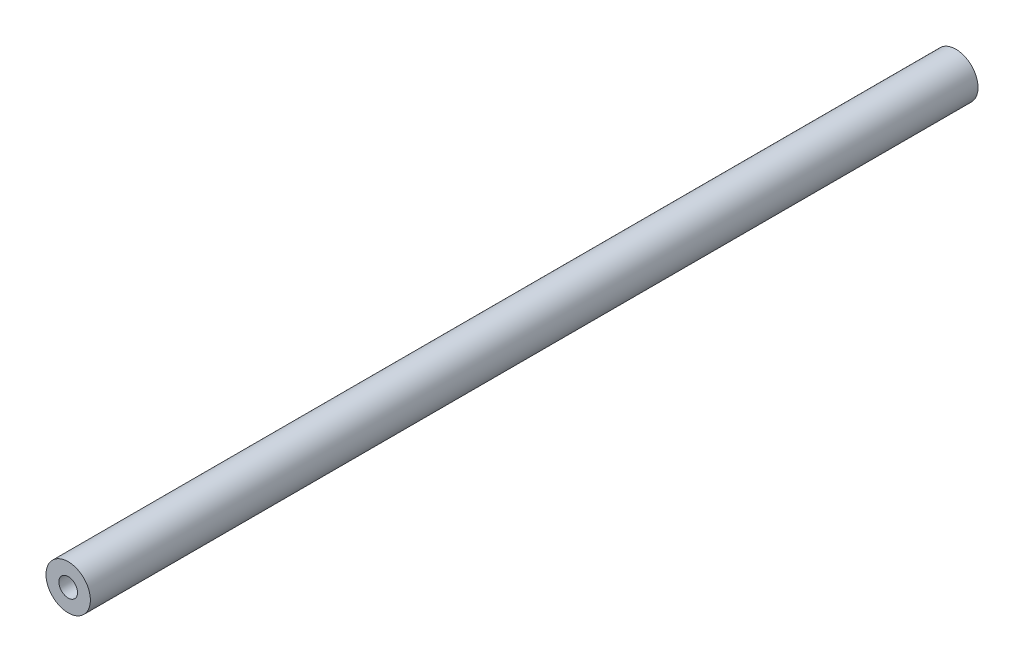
ISO-10303-21;
HEADER;
FILE_DESCRIPTION(('STEP AP214'),'2;1');
FILE_NAME('part.step','',(''),(''),'','','');
FILE_SCHEMA(('AUTOMOTIVE_DESIGN { 1 0 10303 214 1 1 1 1 }'));
ENDSEC;
DATA;
#1=APPLICATION_CONTEXT('core data for automotive mechanical design processes');
#2=APPLICATION_PROTOCOL_DEFINITION('international standard','automotive_design',2000,#1);
#3=PRODUCT_CONTEXT('',#1,'mechanical');
#4=PRODUCT('Part','Part','',(#3));
#5=PRODUCT_RELATED_PRODUCT_CATEGORY('part','',(#4));
#6=PRODUCT_DEFINITION_FORMATION('','',#4);
#7=PRODUCT_DEFINITION_CONTEXT('part definition',#1,'design');
#8=PRODUCT_DEFINITION('design','',#6,#7);
#9=PRODUCT_DEFINITION_SHAPE('','',#8);
#10=(LENGTH_UNIT() NAMED_UNIT(*) SI_UNIT(.MILLI.,.METRE.));
#11=(NAMED_UNIT(*) PLANE_ANGLE_UNIT() SI_UNIT($,.RADIAN.));
#12=(NAMED_UNIT(*) SI_UNIT($,.STERADIAN.) SOLID_ANGLE_UNIT());
#13=UNCERTAINTY_MEASURE_WITH_UNIT(LENGTH_MEASURE(1.E-05),#10,'distance_accuracy_value','');
#14=(GEOMETRIC_REPRESENTATION_CONTEXT(3) GLOBAL_UNCERTAINTY_ASSIGNED_CONTEXT((#13)) GLOBAL_UNIT_ASSIGNED_CONTEXT((#10,
#11,#12)) REPRESENTATION_CONTEXT('',''));
#15=CARTESIAN_POINT('',(0.,0.,0.));
#16=DIRECTION('',(0.,0.,1.));
#17=DIRECTION('',(1.,0.,0.));
#18=AXIS2_PLACEMENT_3D('',#15,#16,#17);
#19=CARTESIAN_POINT('',(0.,0.,187.599999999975));
#20=DIRECTION('',(0.,0.,1.));
#21=DIRECTION('',(1.,0.,0.));
#22=AXIS2_PLACEMENT_3D('',#19,#20,#21);
#23=CONICAL_SURFACE('',#22,2.10000000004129,1.02974425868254);
#24=CARTESIAN_POINT('',(0.,0.,186.33819270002));
#25=VERTEX_POINT('',#24);
#26=VERTEX_LOOP('',#25);
#27=FACE_BOUND('',#26,.T.);
#28=CARTESIAN_POINT('',(0.,0.,187.6));
#29=DIRECTION('',(0.,0.,1.));
#30=DIRECTION('',(1.,0.,0.));
#31=AXIS2_PLACEMENT_3D('',#28,#29,#30);
#32=CIRCLE('',#31,2.09999999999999);
#33=CARTESIAN_POINT('',(2.09999999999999,0.,187.6));
#34=VERTEX_POINT('',#33);
#35=EDGE_CURVE('E37',#34,#34,#32,.T.);
#36=ORIENTED_EDGE('',*,*,#35,.T.);
#37=EDGE_LOOP('',(#36));
#38=FACE_BOUND('',#37,.T.);
#39=ADVANCED_FACE('F17',(#27,#38),#23,.F.);
#40=CARTESIAN_POINT('',(0.,0.,12.4000000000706));
#41=DIRECTION('',(0.,0.,-1.));
#42=DIRECTION('',(-1.,0.,0.));
#43=AXIS2_PLACEMENT_3D('',#40,#41,#42);
#44=CONICAL_SURFACE('',#43,2.09999999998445,1.0297442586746);
#45=CARTESIAN_POINT('',(0.,0.,13.661807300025));
#46=VERTEX_POINT('',#45);
#47=VERTEX_LOOP('',#46);
#48=FACE_BOUND('',#47,.T.);
#49=CARTESIAN_POINT('',(0.,0.,12.4));
#50=DIRECTION('',(0.,0.,-1.));
#51=DIRECTION('',(-1.,0.,0.));
#52=AXIS2_PLACEMENT_3D('',#49,#50,#51);
#53=CIRCLE('',#52,2.1);
#54=CARTESIAN_POINT('',(-2.1,0.,12.4));
#55=VERTEX_POINT('',#54);
#56=EDGE_CURVE('E39',#55,#55,#53,.T.);
#57=ORIENTED_EDGE('',*,*,#56,.T.);
#58=EDGE_LOOP('',(#57));
#59=FACE_BOUND('',#58,.T.);
#60=ADVANCED_FACE('F34',(#48,#59),#44,.F.);
#61=CARTESIAN_POINT('',(0.,0.,200.));
#62=DIRECTION('',(0.,0.,1.));
#63=DIRECTION('',(1.,0.,0.));
#64=AXIS2_PLACEMENT_3D('',#61,#62,#63);
#65=CYLINDRICAL_SURFACE('',#64,2.09999999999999);
#66=CARTESIAN_POINT('',(0.,0.,200.));
#67=DIRECTION('',(0.,0.,1.));
#68=DIRECTION('',(1.,0.,0.));
#69=AXIS2_PLACEMENT_3D('',#66,#67,#68);
#70=CIRCLE('',#69,2.09999999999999);
#71=CARTESIAN_POINT('',(2.09999999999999,0.,200.));
#72=VERTEX_POINT('',#71);
#73=EDGE_CURVE('E20',#72,#72,#70,.F.);
#74=ORIENTED_EDGE('',*,*,#73,.F.);
#75=EDGE_LOOP('',(#74));
#76=FACE_BOUND('',#75,.T.);
#77=ORIENTED_EDGE('',*,*,#35,.F.);
#78=EDGE_LOOP('',(#77));
#79=FACE_BOUND('',#78,.T.);
#80=ADVANCED_FACE('F54',(#76,#79),#65,.F.);
#81=CARTESIAN_POINT('',(0.,0.,0.));
#82=DIRECTION('',(0.,0.,-1.));
#83=DIRECTION('',(-1.,0.,0.));
#84=AXIS2_PLACEMENT_3D('',#81,#82,#83);
#85=CYLINDRICAL_SURFACE('',#84,2.1);
#86=ORIENTED_EDGE('',*,*,#56,.F.);
#87=EDGE_LOOP('',(#86));
#88=FACE_BOUND('',#87,.T.);
#89=CARTESIAN_POINT('',(0.,0.,0.));
#90=DIRECTION('',(0.,0.,-1.));
#91=DIRECTION('',(-1.,0.,0.));
#92=AXIS2_PLACEMENT_3D('',#89,#90,#91);
#93=CIRCLE('',#92,2.1);
#94=CARTESIAN_POINT('',(-2.1,0.,0.));
#95=VERTEX_POINT('',#94);
#96=EDGE_CURVE('E45',#95,#95,#93,.T.);
#97=ORIENTED_EDGE('',*,*,#96,.T.);
#98=EDGE_LOOP('',(#97));
#99=FACE_BOUND('',#98,.T.);
#100=ADVANCED_FACE('F56',(#88,#99),#85,.F.);
#101=CARTESIAN_POINT('',(0.,0.,200.));
#102=DIRECTION('',(0.,0.,1.));
#103=DIRECTION('',(1.,0.,0.));
#104=AXIS2_PLACEMENT_3D('',#101,#102,#103);
#105=PLANE('',#104);
#106=CARTESIAN_POINT('',(0.,0.,200.));
#107=DIRECTION('',(0.,0.,-1.));
#108=DIRECTION('',(-1.,0.,0.));
#109=AXIS2_PLACEMENT_3D('',#106,#107,#108);
#110=CIRCLE('',#109,5.);
#111=CARTESIAN_POINT('',(-5.,0.,200.));
#112=VERTEX_POINT('',#111);
#113=EDGE_CURVE('E26',#112,#112,#110,.T.);
#114=ORIENTED_EDGE('',*,*,#113,.F.);
#115=EDGE_LOOP('',(#114));
#116=FACE_BOUND('',#115,.T.);
#117=ORIENTED_EDGE('',*,*,#73,.T.);
#118=EDGE_LOOP('',(#117));
#119=FACE_BOUND('',#118,.T.);
#120=ADVANCED_FACE('F52',(#116,#119),#105,.T.);
#121=CARTESIAN_POINT('',(0.,0.,0.));
#122=DIRECTION('',(0.,0.,1.));
#123=DIRECTION('',(1.,0.,0.));
#124=AXIS2_PLACEMENT_3D('',#121,#122,#123);
#125=PLANE('',#124);
#126=CARTESIAN_POINT('',(0.,0.,0.));
#127=DIRECTION('',(0.,0.,-1.));
#128=DIRECTION('',(-1.,0.,0.));
#129=AXIS2_PLACEMENT_3D('',#126,#127,#128);
#130=CIRCLE('',#129,5.);
#131=CARTESIAN_POINT('',(-5.,0.,0.));
#132=VERTEX_POINT('',#131);
#133=EDGE_CURVE('E11',#132,#132,#130,.F.);
#134=ORIENTED_EDGE('',*,*,#133,.F.);
#135=EDGE_LOOP('',(#134));
#136=FACE_BOUND('',#135,.T.);
#137=ORIENTED_EDGE('',*,*,#96,.F.);
#138=EDGE_LOOP('',(#137));
#139=FACE_BOUND('',#138,.T.);
#140=ADVANCED_FACE('F67',(#136,#139),#125,.F.);
#141=CARTESIAN_POINT('',(0.,0.,200.));
#142=DIRECTION('',(0.,0.,-1.));
#143=DIRECTION('',(-1.,0.,0.));
#144=AXIS2_PLACEMENT_3D('',#141,#142,#143);
#145=CYLINDRICAL_SURFACE('',#144,5.);
#146=ORIENTED_EDGE('',*,*,#133,.T.);
#147=EDGE_LOOP('',(#146));
#148=FACE_BOUND('',#147,.T.);
#149=ORIENTED_EDGE('',*,*,#113,.T.);
#150=EDGE_LOOP('',(#149));
#151=FACE_BOUND('',#150,.T.);
#152=ADVANCED_FACE('F65',(#148,#151),#145,.T.);
#153=CLOSED_SHELL('',(#39,#60,#80,#100,#120,#140,#152));
#154=MANIFOLD_SOLID_BREP('B1',#153);
#155=ADVANCED_BREP_SHAPE_REPRESENTATION('',(#18,#154),#14);
#156=SHAPE_DEFINITION_REPRESENTATION(#9,#155);
ENDSEC;
END-ISO-10303-21;
